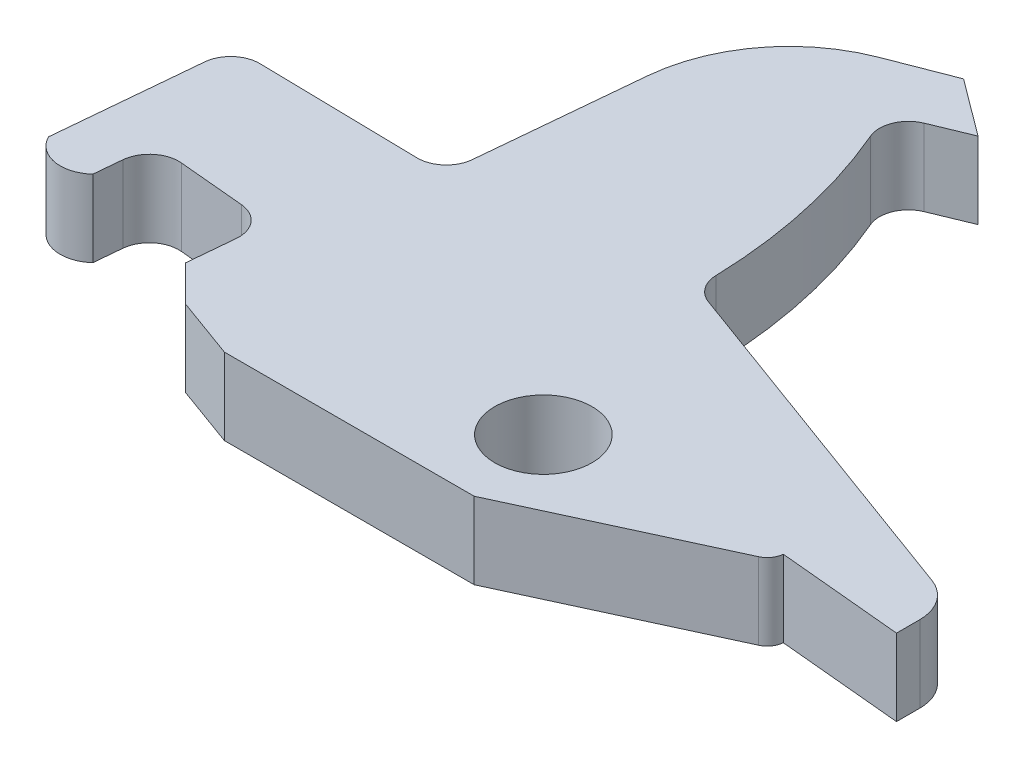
from build123d import *

# Parameters (mm, degrees)
SKETCH2_R           = 1.971678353
BOSS_EXTRUDE1_DEPTH = 3.105758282


with BuildPart() as part:
    # Sketch2 → Boss-Extrude1 (new body)
    with BuildSketch(Plane(origin=(0, 0, 0), x_dir=(1, 0, 0), z_dir=(0, 1, 0))):
        with BuildLine():
            Line((0.917649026, 9.811360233), (0.384605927, 4.027593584))
            ThreePointArc((0.384605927, 4.027593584), (1.383712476, 3.264776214), (2.591182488, 3.614233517))
            Line((2.591182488, 3.614233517), (2.693335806, 4.722644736))
            ThreePointArc((2.693335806, 4.722644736), (3.117853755, 5.528987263), (3.988203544, 5.798978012))
            Line((3.988203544, 5.798978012), (6.675564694, 5.551305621))
            ThreePointArc((6.675564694, 5.551305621), (7.481907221, 5.126787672), (7.75189797, 4.256437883))
            Line((7.75189797, 4.256437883), (7.578954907, 2.379924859))
            Line((7.578954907, 2.379924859), (9.02702692, 0.932452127))
            Line((9.02702692, 0.932452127), (11.495056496, 0.034741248))
            Line((11.495056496, 0.034741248), (21.60850556, 0.036834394))
            Line((21.60850556, 0.036834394), (29.490163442, 3.675209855))
            ThreePointArc((29.490163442, 3.675209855), (29.776798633, 3.913539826), (29.906313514, 4.263092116))
            Line((29.906313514, 4.263092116), (34.964042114, 3.787927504))
            Line((34.964042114, 3.787927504), (34.964042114, 4.735049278))
            ThreePointArc((34.964042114, 4.735049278), (34.653192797, 5.723163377), (33.832617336, 6.35534427))
            Line((33.832617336, 6.35534427), (19.531048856, 11.602593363))
            ThreePointArc((19.531048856, 11.602593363), (18.984629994, 12.017730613), (18.765525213, 12.668042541))
            ThreePointArc((18.765525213, 12.668042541), (18.265681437, 16.764584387), (17.005136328, 20.694282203))
            ThreePointArc((17.005136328, 20.694282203), (16.99722131, 21.595884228), (17.6335399, 22.234670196))
            Line((17.6335399, 22.234670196), (19.180418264, 22.87271544))
            Line((19.180418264, 22.87271544), (16.882885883, 24.586690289))
            Line((16.882885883, 24.586690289), (14.400892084, 23.624025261))
            ThreePointArc((14.400892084, 23.624025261), (11.631398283, 21.532687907), (10.374970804, 18.297695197))
            Line((10.374970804, 18.297695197), (9.7651047, 11.806182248))
            ThreePointArc((9.7651047, 11.806182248), (9.380047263, 11.043958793), (8.579272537, 10.747287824))
            Line((8.579272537, 10.747287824), (2.103672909, 10.872314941))
            ThreePointArc((2.103672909, 10.872314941), (1.302126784, 10.574954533), (0.917649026, 9.811360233))
        make_face()
        with Locations(Location((20.852367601, 3.597398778, 0), (0, 0, 270))):
            Circle(SKETCH2_R, mode=Mode.SUBTRACT)
    extrude(amount=-BOSS_EXTRUDE1_DEPTH)


solid = part.part
